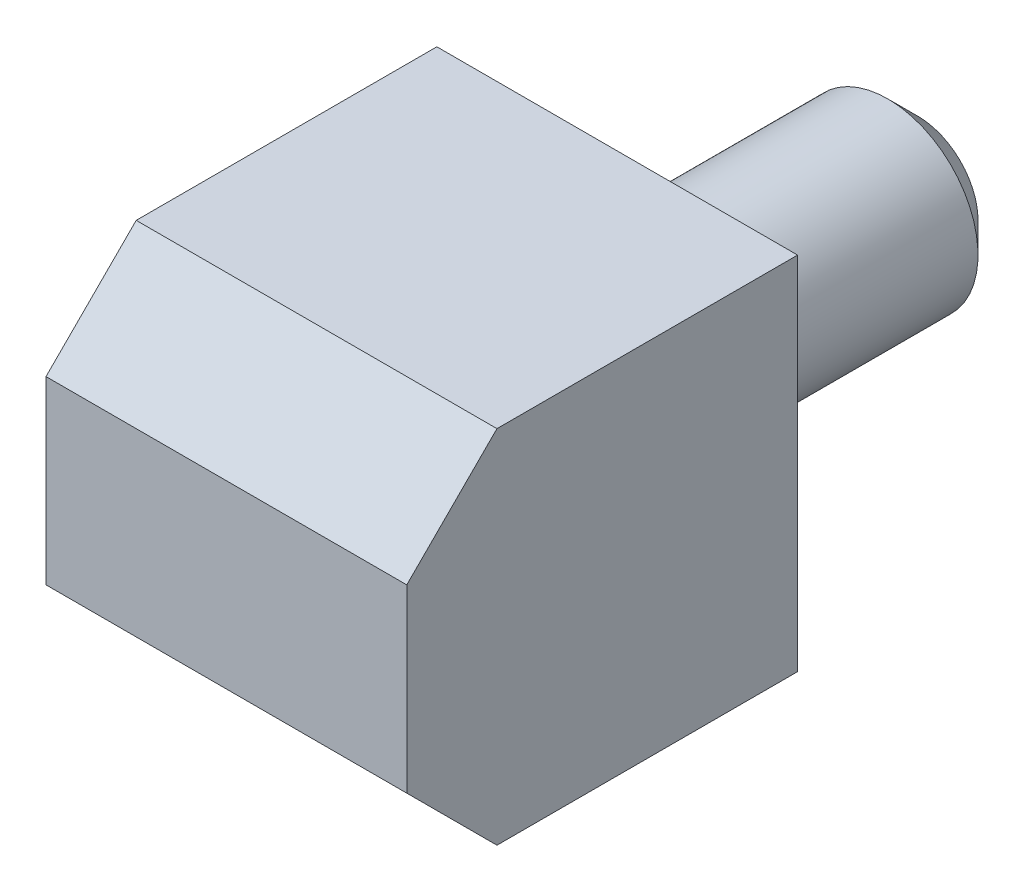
ISO-10303-21;
HEADER;
FILE_DESCRIPTION(('STEP AP214'),'2;1');
FILE_NAME('part.step','',(''),(''),'','','');
FILE_SCHEMA(('AUTOMOTIVE_DESIGN { 1 0 10303 214 1 1 1 1 }'));
ENDSEC;
DATA;
#1=APPLICATION_CONTEXT('core data for automotive mechanical design processes');
#2=APPLICATION_PROTOCOL_DEFINITION('international standard','automotive_design',2000,#1);
#3=PRODUCT_CONTEXT('',#1,'mechanical');
#4=PRODUCT('Part','Part','',(#3));
#5=PRODUCT_RELATED_PRODUCT_CATEGORY('part','',(#4));
#6=PRODUCT_DEFINITION_FORMATION('','',#4);
#7=PRODUCT_DEFINITION_CONTEXT('part definition',#1,'design');
#8=PRODUCT_DEFINITION('design','',#6,#7);
#9=PRODUCT_DEFINITION_SHAPE('','',#8);
#10=(LENGTH_UNIT() NAMED_UNIT(*) SI_UNIT(.MILLI.,.METRE.));
#11=(NAMED_UNIT(*) PLANE_ANGLE_UNIT() SI_UNIT($,.RADIAN.));
#12=(NAMED_UNIT(*) SI_UNIT($,.STERADIAN.) SOLID_ANGLE_UNIT());
#13=UNCERTAINTY_MEASURE_WITH_UNIT(LENGTH_MEASURE(1.E-05),#10,'distance_accuracy_value','');
#14=(GEOMETRIC_REPRESENTATION_CONTEXT(3) GLOBAL_UNCERTAINTY_ASSIGNED_CONTEXT((#13)) GLOBAL_UNIT_ASSIGNED_CONTEXT((#10,
#11,#12)) REPRESENTATION_CONTEXT('',''));
#15=CARTESIAN_POINT('',(0.,0.,0.));
#16=DIRECTION('',(0.,0.,1.));
#17=DIRECTION('',(1.,0.,0.));
#18=AXIS2_PLACEMENT_3D('',#15,#16,#17);
#19=CARTESIAN_POINT('',(-6.,-6.,0.));
#20=DIRECTION('',(0.,0.,-1.));
#21=DIRECTION('',(-1.,0.,0.));
#22=AXIS2_PLACEMENT_3D('',#19,#20,#21);
#23=PLANE('',#22);
#24=CARTESIAN_POINT('',(0.,0.,0.));
#25=DIRECTION('',(0.,0.,-1.));
#26=DIRECTION('',(-1.,0.,0.));
#27=AXIS2_PLACEMENT_3D('',#24,#25,#26);
#28=CIRCLE('',#27,3.);
#29=CARTESIAN_POINT('',(-3.,0.,0.));
#30=VERTEX_POINT('',#29);
#31=EDGE_CURVE('E100',#30,#30,#28,.T.);
#32=ORIENTED_EDGE('',*,*,#31,.F.);
#33=EDGE_LOOP('',(#32));
#34=FACE_BOUND('',#33,.T.);
#35=DIRECTION('',(1.,0.,0.));
#36=VECTOR('',#35,1.);
#37=CARTESIAN_POINT('',(-6.,-6.,0.));
#38=LINE('',#37,#36);
#39=CARTESIAN_POINT('',(-6.,-6.,0.));
#40=VERTEX_POINT('',#39);
#41=CARTESIAN_POINT('',(6.,-6.,0.));
#42=VERTEX_POINT('',#41);
#43=EDGE_CURVE('E89',#40,#42,#38,.T.);
#44=ORIENTED_EDGE('',*,*,#43,.F.);
#45=DIRECTION('',(0.,1.,0.));
#46=VECTOR('',#45,1.);
#47=CARTESIAN_POINT('',(-6.,-6.,0.));
#48=LINE('',#47,#46);
#49=CARTESIAN_POINT('',(-6.,6.,0.));
#50=VERTEX_POINT('',#49);
#51=EDGE_CURVE('E88',#40,#50,#48,.T.);
#52=ORIENTED_EDGE('',*,*,#51,.T.);
#53=DIRECTION('',(1.,0.,0.));
#54=VECTOR('',#53,1.);
#55=CARTESIAN_POINT('',(-6.,6.,0.));
#56=LINE('',#55,#54);
#57=CARTESIAN_POINT('',(6.,6.,0.));
#58=VERTEX_POINT('',#57);
#59=EDGE_CURVE('E75',#50,#58,#56,.T.);
#60=ORIENTED_EDGE('',*,*,#59,.T.);
#61=DIRECTION('',(0.,1.,0.));
#62=VECTOR('',#61,1.);
#63=CARTESIAN_POINT('',(6.,-6.,0.));
#64=LINE('',#63,#62);
#65=EDGE_CURVE('E82',#42,#58,#64,.T.);
#66=ORIENTED_EDGE('',*,*,#65,.F.);
#67=EDGE_LOOP('',(#44,#52,#60,#66));
#68=FACE_BOUND('',#67,.T.);
#69=ADVANCED_FACE('F14',(#34,#68),#23,.T.);
#70=CARTESIAN_POINT('',(-6.,-6.,0.));
#71=DIRECTION('',(0.,1.,0.));
#72=DIRECTION('',(-1.,0.,0.));
#73=AXIS2_PLACEMENT_3D('',#70,#71,#72);
#74=PLANE('',#73);
#75=DIRECTION('',(0.,0.,1.));
#76=VECTOR('',#75,1.);
#77=CARTESIAN_POINT('',(6.,-6.,0.));
#78=LINE('',#77,#76);
#79=CARTESIAN_POINT('',(6.,-6.,10.));
#80=VERTEX_POINT('',#79);
#81=EDGE_CURVE('E93',#42,#80,#78,.T.);
#82=ORIENTED_EDGE('',*,*,#81,.T.);
#83=DIRECTION('',(-1.,0.,0.));
#84=VECTOR('',#83,1.);
#85=CARTESIAN_POINT('',(-6.,-6.,10.));
#86=LINE('',#85,#84);
#87=CARTESIAN_POINT('',(-6.,-6.,10.));
#88=VERTEX_POINT('',#87);
#89=EDGE_CURVE('E29',#80,#88,#86,.T.);
#90=ORIENTED_EDGE('',*,*,#89,.T.);
#91=DIRECTION('',(0.,0.,1.));
#92=VECTOR('',#91,1.);
#93=CARTESIAN_POINT('',(-6.,-6.,0.));
#94=LINE('',#93,#92);
#95=EDGE_CURVE('E90',#40,#88,#94,.T.);
#96=ORIENTED_EDGE('',*,*,#95,.F.);
#97=ORIENTED_EDGE('',*,*,#43,.T.);
#98=EDGE_LOOP('',(#82,#90,#96,#97));
#99=FACE_BOUND('',#98,.T.);
#100=ADVANCED_FACE('F135',(#99),#74,.F.);
#101=CARTESIAN_POINT('',(-6.,6.,13.));
#102=DIRECTION('',(0.,0.,1.));
#103=DIRECTION('',(1.,0.,0.));
#104=AXIS2_PLACEMENT_3D('',#101,#102,#103);
#105=PLANE('',#104);
#106=DIRECTION('',(0.,-1.,0.));
#107=VECTOR('',#106,1.);
#108=CARTESIAN_POINT('',(6.,6.,13.));
#109=LINE('',#108,#107);
#110=CARTESIAN_POINT('',(6.,3.,13.));
#111=VERTEX_POINT('',#110);
#112=CARTESIAN_POINT('',(6.,-2.99999999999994,13.));
#113=VERTEX_POINT('',#112);
#114=EDGE_CURVE('E81',#111,#113,#109,.T.);
#115=ORIENTED_EDGE('',*,*,#114,.F.);
#116=DIRECTION('',(-1.,0.,0.));
#117=VECTOR('',#116,1.);
#118=CARTESIAN_POINT('',(-6.,3.,13.));
#119=LINE('',#118,#117);
#120=CARTESIAN_POINT('',(-6.,3.,13.));
#121=VERTEX_POINT('',#120);
#122=EDGE_CURVE('E121',#111,#121,#119,.T.);
#123=ORIENTED_EDGE('',*,*,#122,.T.);
#124=DIRECTION('',(0.,-1.,0.));
#125=VECTOR('',#124,1.);
#126=CARTESIAN_POINT('',(-6.,6.,13.));
#127=LINE('',#126,#125);
#128=CARTESIAN_POINT('',(-6.,-2.99999999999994,13.));
#129=VERTEX_POINT('',#128);
#130=EDGE_CURVE('E109',#121,#129,#127,.T.);
#131=ORIENTED_EDGE('',*,*,#130,.T.);
#132=DIRECTION('',(1.,0.,0.));
#133=VECTOR('',#132,1.);
#134=CARTESIAN_POINT('',(6.,-2.99999999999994,13.));
#135=LINE('',#134,#133);
#136=EDGE_CURVE('E118',#129,#113,#135,.T.);
#137=ORIENTED_EDGE('',*,*,#136,.T.);
#138=EDGE_LOOP('',(#115,#123,#131,#137));
#139=FACE_BOUND('',#138,.T.);
#140=ADVANCED_FACE('F142',(#139),#105,.T.);
#141=CARTESIAN_POINT('',(-6.,6.,13.));
#142=DIRECTION('',(0.,-1.,0.));
#143=DIRECTION('',(0.,0.,1.));
#144=AXIS2_PLACEMENT_3D('',#141,#142,#143);
#145=PLANE('',#144);
#146=DIRECTION('',(0.,0.,-1.));
#147=VECTOR('',#146,1.);
#148=CARTESIAN_POINT('',(-6.,6.,13.));
#149=LINE('',#148,#147);
#150=CARTESIAN_POINT('',(-6.,6.,10.));
#151=VERTEX_POINT('',#150);
#152=EDGE_CURVE('E107',#151,#50,#149,.T.);
#153=ORIENTED_EDGE('',*,*,#152,.F.);
#154=DIRECTION('',(1.,0.,0.));
#155=VECTOR('',#154,1.);
#156=CARTESIAN_POINT('',(6.,6.,10.));
#157=LINE('',#156,#155);
#158=CARTESIAN_POINT('',(6.,6.,10.));
#159=VERTEX_POINT('',#158);
#160=EDGE_CURVE('E78',#151,#159,#157,.T.);
#161=ORIENTED_EDGE('',*,*,#160,.T.);
#162=DIRECTION('',(0.,0.,-1.));
#163=VECTOR('',#162,1.);
#164=CARTESIAN_POINT('',(6.,6.,13.));
#165=LINE('',#164,#163);
#166=EDGE_CURVE('E71',#159,#58,#165,.T.);
#167=ORIENTED_EDGE('',*,*,#166,.T.);
#168=ORIENTED_EDGE('',*,*,#59,.F.);
#169=EDGE_LOOP('',(#153,#161,#167,#168));
#170=FACE_BOUND('',#169,.T.);
#171=ADVANCED_FACE('F74',(#170),#145,.F.);
#172=CARTESIAN_POINT('',(-6.,-6.,0.));
#173=DIRECTION('',(1.,0.,0.));
#174=DIRECTION('',(0.,0.,-1.));
#175=AXIS2_PLACEMENT_3D('',#172,#173,#174);
#176=PLANE('',#175);
#177=CARTESIAN_POINT('',(-6.,0.,7.5));
#178=DIRECTION('',(-1.,0.,0.));
#179=DIRECTION('',(0.,0.,1.));
#180=AXIS2_PLACEMENT_3D('',#177,#178,#179);
#181=CIRCLE('',#180,3.);
#182=CARTESIAN_POINT('',(-6.,0.,10.5));
#183=VERTEX_POINT('',#182);
#184=EDGE_CURVE('E97',#183,#183,#181,.T.);
#185=ORIENTED_EDGE('',*,*,#184,.F.);
#186=EDGE_LOOP('',(#185));
#187=FACE_BOUND('',#186,.T.);
#188=ORIENTED_EDGE('',*,*,#130,.F.);
#189=DIRECTION('',(0.,0.707106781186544,-0.707106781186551));
#190=VECTOR('',#189,1.);
#191=CARTESIAN_POINT('',(-6.,6.,10.));
#192=LINE('',#191,#190);
#193=EDGE_CURVE('E124',#121,#151,#192,.T.);
#194=ORIENTED_EDGE('',*,*,#193,.T.);
#195=ORIENTED_EDGE('',*,*,#152,.T.);
#196=ORIENTED_EDGE('',*,*,#51,.F.);
#197=ORIENTED_EDGE('',*,*,#95,.T.);
#198=DIRECTION('',(0.,0.707106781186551,0.707106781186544));
#199=VECTOR('',#198,1.);
#200=CARTESIAN_POINT('',(-6.,-2.99999999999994,13.));
#201=LINE('',#200,#199);
#202=EDGE_CURVE('E36',#88,#129,#201,.T.);
#203=ORIENTED_EDGE('',*,*,#202,.T.);
#204=EDGE_LOOP('',(#188,#194,#195,#196,#197,#203));
#205=FACE_BOUND('',#204,.T.);
#206=ADVANCED_FACE('F145',(#187,#205),#176,.F.);
#207=CARTESIAN_POINT('',(6.,-6.,0.));
#208=DIRECTION('',(1.,0.,0.));
#209=DIRECTION('',(0.,0.,-1.));
#210=AXIS2_PLACEMENT_3D('',#207,#208,#209);
#211=PLANE('',#210);
#212=ORIENTED_EDGE('',*,*,#166,.F.);
#213=DIRECTION('',(0.,-0.707106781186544,0.707106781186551));
#214=VECTOR('',#213,1.);
#215=CARTESIAN_POINT('',(6.,5.,11.));
#216=LINE('',#215,#214);
#217=EDGE_CURVE('E116',#159,#111,#216,.T.);
#218=ORIENTED_EDGE('',*,*,#217,.T.);
#219=ORIENTED_EDGE('',*,*,#114,.T.);
#220=DIRECTION('',(0.,-0.707106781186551,-0.707106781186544));
#221=VECTOR('',#220,1.);
#222=CARTESIAN_POINT('',(6.,-11.,5.));
#223=LINE('',#222,#221);
#224=EDGE_CURVE('E114',#113,#80,#223,.T.);
#225=ORIENTED_EDGE('',*,*,#224,.T.);
#226=ORIENTED_EDGE('',*,*,#81,.F.);
#227=ORIENTED_EDGE('',*,*,#65,.T.);
#228=EDGE_LOOP('',(#212,#218,#219,#225,#226,#227));
#229=FACE_BOUND('',#228,.T.);
#230=ADVANCED_FACE('F92',(#229),#211,.T.);
#231=CARTESIAN_POINT('',(-6.,6.,10.));
#232=DIRECTION('',(0.,0.707106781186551,0.707106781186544));
#233=DIRECTION('',(0.,0.707106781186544,-0.707106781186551));
#234=AXIS2_PLACEMENT_3D('',#231,#232,#233);
#235=PLANE('',#234);
#236=ORIENTED_EDGE('',*,*,#193,.F.);
#237=ORIENTED_EDGE('',*,*,#122,.F.);
#238=ORIENTED_EDGE('',*,*,#217,.F.);
#239=ORIENTED_EDGE('',*,*,#160,.F.);
#240=EDGE_LOOP('',(#236,#237,#238,#239));
#241=FACE_BOUND('',#240,.T.);
#242=ADVANCED_FACE('F161',(#241),#235,.T.);
#243=CARTESIAN_POINT('',(-6.,-2.99999999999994,13.));
#244=DIRECTION('',(0.,-0.707106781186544,0.707106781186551));
#245=DIRECTION('',(0.,0.707106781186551,0.707106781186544));
#246=AXIS2_PLACEMENT_3D('',#243,#244,#245);
#247=PLANE('',#246);
#248=ORIENTED_EDGE('',*,*,#202,.F.);
#249=ORIENTED_EDGE('',*,*,#89,.F.);
#250=ORIENTED_EDGE('',*,*,#224,.F.);
#251=ORIENTED_EDGE('',*,*,#136,.F.);
#252=EDGE_LOOP('',(#248,#249,#250,#251));
#253=FACE_BOUND('',#252,.T.);
#254=ADVANCED_FACE('F169',(#253),#247,.T.);
#255=CARTESIAN_POINT('',(0.,0.,-10.));
#256=DIRECTION('',(0.,0.,1.));
#257=DIRECTION('',(1.,0.,0.));
#258=AXIS2_PLACEMENT_3D('',#255,#256,#257);
#259=CYLINDRICAL_SURFACE('',#258,3.);
#260=CARTESIAN_POINT('',(0.,0.,-9.));
#261=DIRECTION('',(0.,0.,-1.));
#262=DIRECTION('',(-1.,0.,0.));
#263=AXIS2_PLACEMENT_3D('',#260,#261,#262);
#264=CIRCLE('',#263,3.);
#265=CARTESIAN_POINT('',(-3.,0.,-9.));
#266=VERTEX_POINT('',#265);
#267=EDGE_CURVE('E9',#266,#266,#264,.F.);
#268=ORIENTED_EDGE('',*,*,#267,.T.);
#269=EDGE_LOOP('',(#268));
#270=FACE_BOUND('',#269,.T.);
#271=ORIENTED_EDGE('',*,*,#31,.T.);
#272=EDGE_LOOP('',(#271));
#273=FACE_BOUND('',#272,.T.);
#274=ADVANCED_FACE('F132',(#270,#273),#259,.T.);
#275=CARTESIAN_POINT('',(0.,0.,-10.));
#276=DIRECTION('',(0.,0.,-1.));
#277=DIRECTION('',(-1.,0.,0.));
#278=AXIS2_PLACEMENT_3D('',#275,#276,#277);
#279=PLANE('',#278);
#280=CARTESIAN_POINT('',(0.,0.,-10.));
#281=DIRECTION('',(0.,0.,-1.));
#282=DIRECTION('',(-1.,0.,0.));
#283=AXIS2_PLACEMENT_3D('',#280,#281,#282);
#284=CIRCLE('',#283,2.);
#285=CARTESIAN_POINT('',(-2.,0.,-10.));
#286=VERTEX_POINT('',#285);
#287=EDGE_CURVE('E22',#286,#286,#284,.T.);
#288=ORIENTED_EDGE('',*,*,#287,.T.);
#289=EDGE_LOOP('',(#288));
#290=FACE_BOUND('',#289,.T.);
#291=ADVANCED_FACE('F172',(#290),#279,.T.);
#292=CARTESIAN_POINT('',(0.,0.,-10.));
#293=DIRECTION('',(0.,0.,1.));
#294=DIRECTION('',(1.,0.,0.));
#295=AXIS2_PLACEMENT_3D('',#292,#293,#294);
#296=CONICAL_SURFACE('',#295,2.,0.785398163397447);
#297=ORIENTED_EDGE('',*,*,#267,.F.);
#298=EDGE_LOOP('',(#297));
#299=FACE_BOUND('',#298,.T.);
#300=ORIENTED_EDGE('',*,*,#287,.F.);
#301=EDGE_LOOP('',(#300));
#302=FACE_BOUND('',#301,.T.);
#303=ADVANCED_FACE('F16',(#299,#302),#296,.T.);
#304=CARTESIAN_POINT('',(2.,0.,7.5));
#305=DIRECTION('',(-1.,0.,0.));
#306=DIRECTION('',(0.,0.,1.));
#307=AXIS2_PLACEMENT_3D('',#304,#305,#306);
#308=CYLINDRICAL_SURFACE('',#307,3.);
#309=CARTESIAN_POINT('',(2.,0.,7.5));
#310=DIRECTION('',(-1.,0.,0.));
#311=DIRECTION('',(0.,0.,1.));
#312=AXIS2_PLACEMENT_3D('',#309,#310,#311);
#313=CIRCLE('',#312,3.);
#314=CARTESIAN_POINT('',(2.,0.,10.5));
#315=VERTEX_POINT('',#314);
#316=EDGE_CURVE('E94',#315,#315,#313,.T.);
#317=ORIENTED_EDGE('',*,*,#316,.F.);
#318=EDGE_LOOP('',(#317));
#319=FACE_BOUND('',#318,.T.);
#320=ORIENTED_EDGE('',*,*,#184,.T.);
#321=EDGE_LOOP('',(#320));
#322=FACE_BOUND('',#321,.T.);
#323=ADVANCED_FACE('F187',(#319,#322),#308,.F.);
#324=CARTESIAN_POINT('',(2.,0.,7.5));
#325=DIRECTION('',(-1.,0.,0.));
#326=DIRECTION('',(0.,0.,1.));
#327=AXIS2_PLACEMENT_3D('',#324,#325,#326);
#328=PLANE('',#327);
#329=ORIENTED_EDGE('',*,*,#316,.T.);
#330=EDGE_LOOP('',(#329));
#331=FACE_BOUND('',#330,.T.);
#332=ADVANCED_FACE('F192',(#331),#328,.T.);
#333=CLOSED_SHELL('',(#69,#100,#140,#171,#206,#230,#242,#254,#274,#291,#303,#323,#332));
#334=MANIFOLD_SOLID_BREP('B1',#333);
#335=ADVANCED_BREP_SHAPE_REPRESENTATION('',(#18,#334),#14);
#336=SHAPE_DEFINITION_REPRESENTATION(#9,#335);
ENDSEC;
END-ISO-10303-21;
